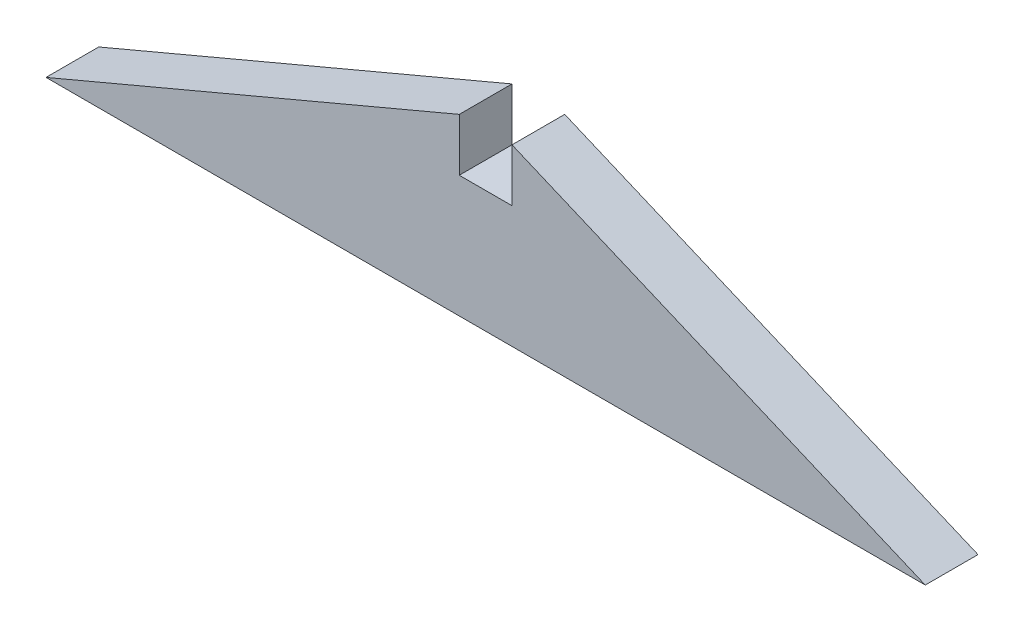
from build123d import *

# Parameters (mm, degrees)
BOSS_EXTRUDE1_DEPTH = 25.4


with BuildPart() as part:
    # Sketch2 → Boss-Extrude1 (new body)
    with BuildSketch(Plane.XY):
        Polygon((-12.7, 234.90945849), (-12.7, 245.302635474), (-12.7, 260.30945849), (-211.757031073, 176.200853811), (211.757031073, 176.200853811), (12.7, 260.30945849), (12.7, 245.302635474), (12.7, 234.90945849), align=None)
    extrude(amount=BOSS_EXTRUDE1_DEPTH)


solid = part.part
